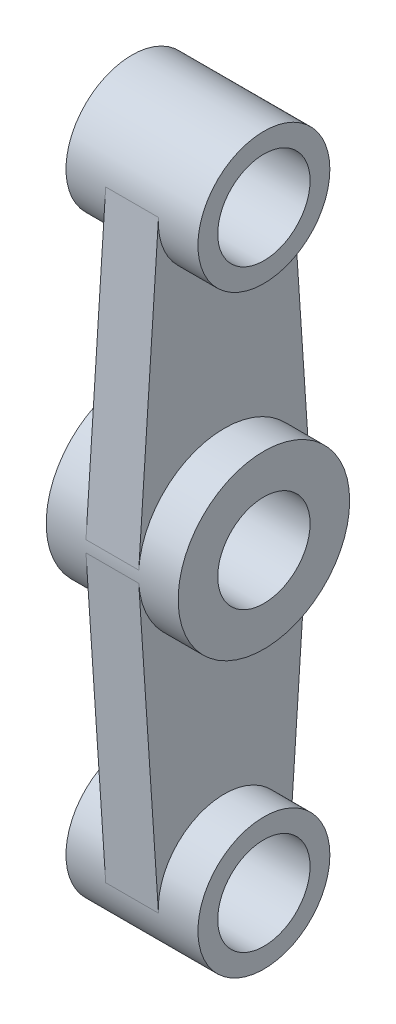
from build123d import *

# Parameters (mm, degrees)
BOSS_EXTRUDE1_DEPTH = 10
BOSS_EXTRUDE2_DEPTH = 10
SKETCH1_4_R         = 25.000000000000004
SKETCH1_4_R_2       = 17.5
BOSS_EXTRUDE3_DEPTH = 25
SKETCH1_5_R         = 32.5
SKETCH1_5_R_2       = 17.500000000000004
SKETCH1_5_R_3       = 25.000000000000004
SKETCH1_5_R_4       = 17.5
BOSS_EXTRUDE4_DEPTH = 25


with BuildPart() as part:
    # Sketch1 → Boss-Extrude1 (new, symmetric)
    with BuildSketch(Plane(origin=(0, 0, 0), x_dir=(0, 0, -1), z_dir=(1, 0, 0))):
        with BuildLine():
            Line((0, -32.5), (0, -87.5))
            ThreePointArc((3.1794e-13, -87.5), (17.677669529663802, -94.82233047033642), (25.000000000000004, -112.5))
            ThreePointArc((25.000000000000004, -112.5), (24.986091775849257, -113.33379719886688), (24.944382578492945, -114.16666666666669))
            Line((24.944382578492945, -114.16666666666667), (32.42769735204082, -2.166666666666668))
            ThreePointArc((32.42769735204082, -2.166666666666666), (22.201726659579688, -23.734644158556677), (1.49505e-12, -32.5))
        make_face()
        with BuildLine():
            ThreePointArc((-24.94438257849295, -114.16666666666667), (-18.25741858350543, -95.42174872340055), (3.1794e-13, -87.5))
            Line((0, -87.5), (0, -32.5))
            ThreePointArc((1.49505e-12, -32.5), (-22.201726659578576, -23.734644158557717), (-32.42769735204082, -2.1666666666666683))
            Line((-32.42769735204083, -2.1666666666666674), (-24.94438257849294, -114.16666666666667))
        make_face()
    extrude(amount=BOSS_EXTRUDE1_DEPTH, both=True)



with BuildPart() as body_2:
    # Sketch1_3 → Boss-Extrude2 (new, symmetric)
    with BuildSketch(Plane(origin=(0, 0, 0), x_dir=(0, 0, -1), z_dir=(1, 0, 0))):
        with BuildLine():
            Line((-24.94438257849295, 114.16666666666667), (-32.42769735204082, 2.1666666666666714))
            ThreePointArc((-32.42769735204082, 2.1666666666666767), (-22.20172665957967, 23.734644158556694), (-1.49903e-12, 32.5))
            Line((0, 32.5), (0, 87.5))
            ThreePointArc((3.0627e-13, 87.5), (-18.25741858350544, 95.42174872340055), (-24.944382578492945, 114.16666666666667))
        make_face()
        with BuildLine():
            Line((0, 87.5), (0, 32.5))
            ThreePointArc((-1.49903e-12, 32.5), (22.201726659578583, 23.73464415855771), (32.42769735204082, 2.1666666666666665))
            Line((32.42769735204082, 2.1666666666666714), (24.944382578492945, 114.16666666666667))
            ThreePointArc((24.94438257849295, 114.16666666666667), (24.98609177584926, 113.33379719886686), (25.000000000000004, 112.5))
            ThreePointArc((25.000000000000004, 112.5), (17.6776695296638, 94.82233047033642), (3.0627e-13, 87.5))
        make_face()
    extrude(amount=BOSS_EXTRUDE2_DEPTH, both=True)

    # Sketch1_4 → Boss-Extrude3 (add, symmetric)
    with BuildSketch(Plane(origin=(0, 0, 0), x_dir=(0, 0, -1), z_dir=(1, 0, 0))):
        with Locations((0, 112.5)):
            Circle(SKETCH1_4_R)
        with Locations((0, 112.5)):
            Circle(SKETCH1_4_R_2, mode=Mode.SUBTRACT)
    extrude(amount=BOSS_EXTRUDE3_DEPTH, both=True)


with BuildPart() as part_1:
    add(part.part)

    add(body_2.part)  # Boss-Extrude4 merges body 2
    # Sketch1_5 → Boss-Extrude4 (add, symmetric)
    # profile 1 of 2: a face of its own
    with BuildSketch(Plane(origin=(0, 0, 0), x_dir=(0, 0, -1), z_dir=(1, 0, 0))):
        Circle(SKETCH1_5_R)
        Circle(SKETCH1_5_R_2, mode=Mode.SUBTRACT)
    # profile 2 of 2: a face of its own
    with BuildSketch(Plane(origin=(0, 0, 0), x_dir=(0, 0, -1), z_dir=(1, 0, 0))):
        with Locations((0, -112.5)):
            Circle(SKETCH1_5_R_3)
        with Locations((0, -112.5)):
            Circle(SKETCH1_5_R_4, mode=Mode.SUBTRACT)
    extrude(amount=BOSS_EXTRUDE4_DEPTH, both=True)


solid = part_1.part
